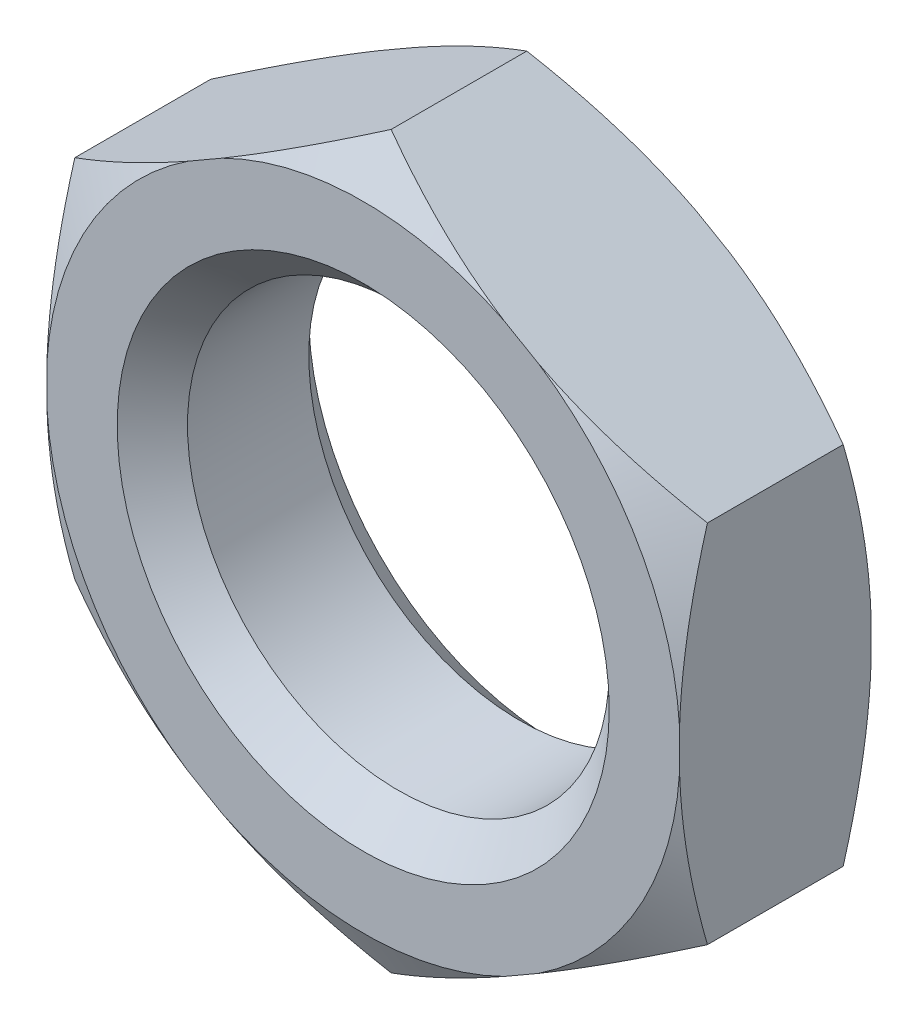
from build123d import *

# Parameters (mm, degrees)
BOSS_EXTRUDE1_DEPTH = 5.45
SKETCH6_R           = 12
CUT_EXTRUDE1_DEPTH  = 10.9
CHAMFER1_SIZE       = 2


with BuildPart() as part:
    # Sketch3 → Boss-Extrude1 (new, symmetric)
    with BuildSketch(Plane.XY):
        Polygon((0, 20.784609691), (-18, 10.392304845), (-18, -10.392304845), (0, -20.784609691), (18, -10.392304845), (18, 10.392304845), align=None)
    extrude(amount=BOSS_EXTRUDE1_DEPTH, both=True)

    # Sketch5 → Cut-Revolve1 (revolve, cut)
    with BuildSketch(Plane(origin=(0, 0, 0), x_dir=(0, 0, -1), z_dir=(1, 0, 0))):
        Polygon((-5.45, 20.784609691), (-5.45, 18.034609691), (-3.86228676, 20.784609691), align=None)
    cut_revolve1 = revolve(axis=Axis((0, 0, 5.457798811), (0, 0, -1)), mode=Mode.SUBTRACT)

    # Mirror1: Cut-Revolve1 across plane
    add(cut_revolve1.mirror(Plane.XY), mode=Mode.SUBTRACT)

    # Sketch6 → Cut-Extrude1 (cut)
    with BuildSketch(Plane.XY.offset(5.45)):
        Circle(SKETCH6_R)
    extrude(amount=-CUT_EXTRUDE1_DEPTH, mode=Mode.SUBTRACT)

    # Chamfer1
    chamfer1_edges = [part.edges().sort_by_distance(p)[0] for p in [
        (-12, 0, -5.45),
        (-12, 0, 5.45),
    ]]
    chamfer(chamfer1_edges, length=CHAMFER1_SIZE)


solid = part.part
